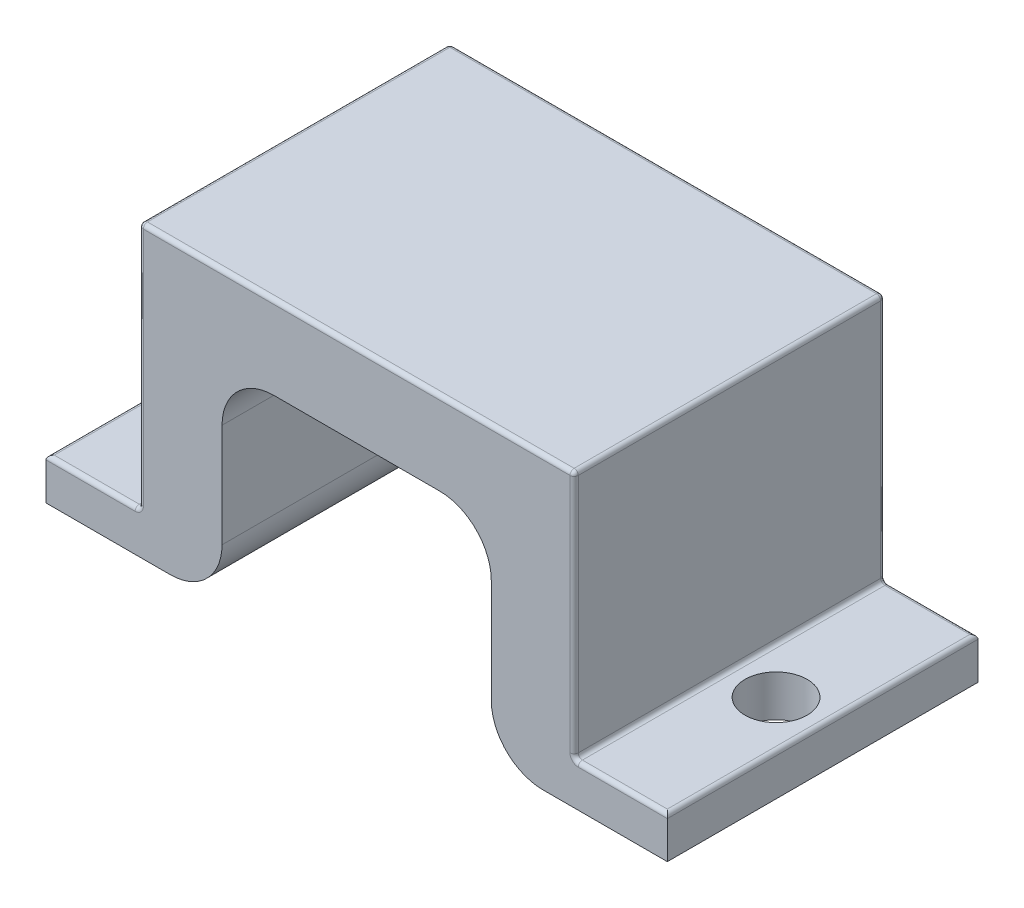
ISO-10303-21;
HEADER;
FILE_DESCRIPTION(('STEP AP214'),'2;1');
FILE_NAME('part.step','',(''),(''),'','','');
FILE_SCHEMA(('AUTOMOTIVE_DESIGN { 1 0 10303 214 1 1 1 1 }'));
ENDSEC;
DATA;
#1=APPLICATION_CONTEXT('core data for automotive mechanical design processes');
#2=APPLICATION_PROTOCOL_DEFINITION('international standard','automotive_design',2000,#1);
#3=PRODUCT_CONTEXT('',#1,'mechanical');
#4=PRODUCT('Part','Part','',(#3));
#5=PRODUCT_RELATED_PRODUCT_CATEGORY('part','',(#4));
#6=PRODUCT_DEFINITION_FORMATION('','',#4);
#7=PRODUCT_DEFINITION_CONTEXT('part definition',#1,'design');
#8=PRODUCT_DEFINITION('design','',#6,#7);
#9=PRODUCT_DEFINITION_SHAPE('','',#8);
#10=(LENGTH_UNIT() NAMED_UNIT(*) SI_UNIT(.MILLI.,.METRE.));
#11=(NAMED_UNIT(*) PLANE_ANGLE_UNIT() SI_UNIT($,.RADIAN.));
#12=(NAMED_UNIT(*) SI_UNIT($,.STERADIAN.) SOLID_ANGLE_UNIT());
#13=UNCERTAINTY_MEASURE_WITH_UNIT(LENGTH_MEASURE(1.E-05),#10,'distance_accuracy_value','');
#14=(GEOMETRIC_REPRESENTATION_CONTEXT(3) GLOBAL_UNCERTAINTY_ASSIGNED_CONTEXT((#13)) GLOBAL_UNIT_ASSIGNED_CONTEXT((#10,
#11,#12)) REPRESENTATION_CONTEXT('',''));
#15=CARTESIAN_POINT('',(0.,0.,0.));
#16=DIRECTION('',(0.,0.,1.));
#17=DIRECTION('',(1.,0.,0.));
#18=AXIS2_PLACEMENT_3D('',#15,#16,#17);
#19=CARTESIAN_POINT('',(-10.4973262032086,2.,15.));
#20=DIRECTION('',(1.,0.,0.));
#21=DIRECTION('',(0.,0.,-1.));
#22=AXIS2_PLACEMENT_3D('',#19,#20,#21);
#23=PLANE('',#22);
#24=DIRECTION('',(0.,-1.,0.));
#25=VECTOR('',#24,1.);
#26=CARTESIAN_POINT('',(-10.4973262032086,2.,15.));
#27=LINE('',#26,#25);
#28=CARTESIAN_POINT('',(-10.4973262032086,1.8,15.));
#29=VERTEX_POINT('',#28);
#30=CARTESIAN_POINT('',(-10.4973262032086,0.,15.));
#31=VERTEX_POINT('',#30);
#32=EDGE_CURVE('E229',#29,#31,#27,.T.);
#33=ORIENTED_EDGE('',*,*,#32,.F.);
#34=DIRECTION('',(0.,0.,-1.));
#35=VECTOR('',#34,1.);
#36=CARTESIAN_POINT('',(-10.4973262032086,1.8,15.));
#37=LINE('',#36,#35);
#38=CARTESIAN_POINT('',(-10.4973262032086,1.8,0.));
#39=VERTEX_POINT('',#38);
#40=EDGE_CURVE('E379',#29,#39,#37,.T.);
#41=ORIENTED_EDGE('',*,*,#40,.T.);
#42=DIRECTION('',(0.,-1.,0.));
#43=VECTOR('',#42,1.);
#44=CARTESIAN_POINT('',(-10.4973262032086,2.,0.));
#45=LINE('',#44,#43);
#46=CARTESIAN_POINT('',(-10.4973262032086,0.,0.));
#47=VERTEX_POINT('',#46);
#48=EDGE_CURVE('E254',#39,#47,#45,.T.);
#49=ORIENTED_EDGE('',*,*,#48,.T.);
#50=DIRECTION('',(0.,0.,-1.));
#51=VECTOR('',#50,1.);
#52=CARTESIAN_POINT('',(-10.4973262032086,0.,15.));
#53=LINE('',#52,#51);
#54=EDGE_CURVE('E249',#31,#47,#53,.T.);
#55=ORIENTED_EDGE('',*,*,#54,.F.);
#56=EDGE_LOOP('',(#33,#41,#49,#55));
#57=FACE_BOUND('',#56,.T.);
#58=ADVANCED_FACE('F44',(#57),#23,.F.);
#59=CARTESIAN_POINT('',(-10.4973262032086,0.,15.));
#60=DIRECTION('',(0.,1.,0.));
#61=DIRECTION('',(0.,0.,1.));
#62=AXIS2_PLACEMENT_3D('',#59,#60,#61);
#63=PLANE('',#62);
#64=CARTESIAN_POINT('',(-8.24732620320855,0.,7.5));
#65=DIRECTION('',(0.,1.,0.));
#66=DIRECTION('',(0.,0.,1.));
#67=AXIS2_PLACEMENT_3D('',#64,#65,#66);
#68=CIRCLE('',#67,1.5);
#69=CARTESIAN_POINT('',(-8.24732620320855,0.,9.));
#70=VERTEX_POINT('',#69);
#71=EDGE_CURVE('E1059',#70,#70,#68,.T.);
#72=ORIENTED_EDGE('',*,*,#71,.T.);
#73=EDGE_LOOP('',(#72));
#74=FACE_BOUND('',#73,.T.);
#75=DIRECTION('',(1.,0.,0.));
#76=VECTOR('',#75,1.);
#77=CARTESIAN_POINT('',(-10.4973262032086,0.,0.));
#78=LINE('',#77,#76);
#79=CARTESIAN_POINT('',(-4.49732620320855,0.,0.));
#80=VERTEX_POINT('',#79);
#81=EDGE_CURVE('E549',#47,#80,#78,.T.);
#82=ORIENTED_EDGE('',*,*,#81,.T.);
#83=DIRECTION('',(0.,0.,-1.));
#84=VECTOR('',#83,1.);
#85=CARTESIAN_POINT('',(-4.49732620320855,0.,15.));
#86=LINE('',#85,#84);
#87=CARTESIAN_POINT('',(-4.49732620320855,0.,15.));
#88=VERTEX_POINT('',#87);
#89=EDGE_CURVE('E250',#80,#88,#86,.F.);
#90=ORIENTED_EDGE('',*,*,#89,.T.);
#91=DIRECTION('',(1.,0.,0.));
#92=VECTOR('',#91,1.);
#93=CARTESIAN_POINT('',(-10.4973262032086,0.,15.));
#94=LINE('',#93,#92);
#95=EDGE_CURVE('E233',#31,#88,#94,.T.);
#96=ORIENTED_EDGE('',*,*,#95,.F.);
#97=ORIENTED_EDGE('',*,*,#54,.T.);
#98=EDGE_LOOP('',(#82,#90,#96,#97));
#99=FACE_BOUND('',#98,.T.);
#100=ADVANCED_FACE('F247',(#74,#99),#63,.F.);
#101=CARTESIAN_POINT('',(-1.99732620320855,0.,15.));
#102=DIRECTION('',(-1.,0.,0.));
#103=DIRECTION('',(0.,0.,1.));
#104=AXIS2_PLACEMENT_3D('',#101,#102,#103);
#105=PLANE('',#104);
#106=DIRECTION('',(0.,1.,0.));
#107=VECTOR('',#106,1.);
#108=CARTESIAN_POINT('',(-1.99732620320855,0.,15.));
#109=LINE('',#108,#107);
#110=CARTESIAN_POINT('',(-1.99732620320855,2.5,15.));
#111=VERTEX_POINT('',#110);
#112=CARTESIAN_POINT('',(-1.99732620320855,7.5,15.));
#113=VERTEX_POINT('',#112);
#114=EDGE_CURVE('E252',#111,#113,#109,.T.);
#115=ORIENTED_EDGE('',*,*,#114,.F.);
#116=DIRECTION('',(0.,0.,-1.));
#117=VECTOR('',#116,1.);
#118=CARTESIAN_POINT('',(-1.99732620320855,2.5,15.));
#119=LINE('',#118,#117);
#120=CARTESIAN_POINT('',(-1.99732620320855,2.5,0.));
#121=VERTEX_POINT('',#120);
#122=EDGE_CURVE('E522',#111,#121,#119,.T.);
#123=ORIENTED_EDGE('',*,*,#122,.T.);
#124=DIRECTION('',(0.,1.,0.));
#125=VECTOR('',#124,1.);
#126=CARTESIAN_POINT('',(-1.99732620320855,0.,0.));
#127=LINE('',#126,#125);
#128=CARTESIAN_POINT('',(-1.99732620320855,7.5,0.));
#129=VERTEX_POINT('',#128);
#130=EDGE_CURVE('E539',#121,#129,#127,.T.);
#131=ORIENTED_EDGE('',*,*,#130,.T.);
#132=DIRECTION('',(0.,0.,-1.));
#133=VECTOR('',#132,1.);
#134=CARTESIAN_POINT('',(-1.99732620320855,7.5,15.));
#135=LINE('',#134,#133);
#136=EDGE_CURVE('E518',#129,#113,#135,.F.);
#137=ORIENTED_EDGE('',*,*,#136,.T.);
#138=EDGE_LOOP('',(#115,#123,#131,#137));
#139=FACE_BOUND('',#138,.T.);
#140=ADVANCED_FACE('F550',(#139),#105,.F.);
#141=CARTESIAN_POINT('',(-1.99732620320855,10.,15.));
#142=DIRECTION('',(0.,1.,0.));
#143=DIRECTION('',(0.,0.,1.));
#144=AXIS2_PLACEMENT_3D('',#141,#142,#143);
#145=PLANE('',#144);
#146=DIRECTION('',(1.,0.,0.));
#147=VECTOR('',#146,1.);
#148=CARTESIAN_POINT('',(-1.99732620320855,10.,0.));
#149=LINE('',#148,#147);
#150=CARTESIAN_POINT('',(0.502673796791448,10.,0.));
#151=VERTEX_POINT('',#150);
#152=CARTESIAN_POINT('',(8.50267379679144,10.,0.));
#153=VERTEX_POINT('',#152);
#154=EDGE_CURVE('E541',#151,#153,#149,.T.);
#155=ORIENTED_EDGE('',*,*,#154,.T.);
#156=DIRECTION('',(0.,0.,-1.));
#157=VECTOR('',#156,1.);
#158=CARTESIAN_POINT('',(8.50267379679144,10.,15.));
#159=LINE('',#158,#157);
#160=CARTESIAN_POINT('',(8.50267379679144,10.,15.));
#161=VERTEX_POINT('',#160);
#162=EDGE_CURVE('E61',#153,#161,#159,.F.);
#163=ORIENTED_EDGE('',*,*,#162,.T.);
#164=DIRECTION('',(1.,0.,0.));
#165=VECTOR('',#164,1.);
#166=CARTESIAN_POINT('',(-1.99732620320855,10.,15.));
#167=LINE('',#166,#165);
#168=CARTESIAN_POINT('',(0.502673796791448,10.,15.));
#169=VERTEX_POINT('',#168);
#170=EDGE_CURVE('E554',#169,#161,#167,.T.);
#171=ORIENTED_EDGE('',*,*,#170,.F.);
#172=DIRECTION('',(0.,0.,-1.));
#173=VECTOR('',#172,1.);
#174=CARTESIAN_POINT('',(0.502673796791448,10.,0.));
#175=LINE('',#174,#173);
#176=EDGE_CURVE('E511',#169,#151,#175,.T.);
#177=ORIENTED_EDGE('',*,*,#176,.T.);
#178=EDGE_LOOP('',(#155,#163,#171,#177));
#179=FACE_BOUND('',#178,.T.);
#180=ADVANCED_FACE('F555',(#179),#145,.F.);
#181=CARTESIAN_POINT('',(11.0026737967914,10.,15.));
#182=DIRECTION('',(1.,0.,0.));
#183=DIRECTION('',(0.,1.,0.));
#184=AXIS2_PLACEMENT_3D('',#181,#182,#183);
#185=PLANE('',#184);
#186=DIRECTION('',(0.,-1.,0.));
#187=VECTOR('',#186,1.);
#188=CARTESIAN_POINT('',(11.0026737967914,10.,0.));
#189=LINE('',#188,#187);
#190=CARTESIAN_POINT('',(11.0026737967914,7.5,0.));
#191=VERTEX_POINT('',#190);
#192=CARTESIAN_POINT('',(11.0026737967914,2.5,0.));
#193=VERTEX_POINT('',#192);
#194=EDGE_CURVE('E574',#191,#193,#189,.T.);
#195=ORIENTED_EDGE('',*,*,#194,.T.);
#196=DIRECTION('',(0.,0.,-1.));
#197=VECTOR('',#196,1.);
#198=CARTESIAN_POINT('',(11.0026737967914,2.5,15.));
#199=LINE('',#198,#197);
#200=CARTESIAN_POINT('',(11.0026737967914,2.5,15.));
#201=VERTEX_POINT('',#200);
#202=EDGE_CURVE('E503',#193,#201,#199,.F.);
#203=ORIENTED_EDGE('',*,*,#202,.T.);
#204=DIRECTION('',(0.,-1.,0.));
#205=VECTOR('',#204,1.);
#206=CARTESIAN_POINT('',(11.0026737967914,10.,15.));
#207=LINE('',#206,#205);
#208=CARTESIAN_POINT('',(11.0026737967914,7.5,15.));
#209=VERTEX_POINT('',#208);
#210=EDGE_CURVE('E556',#209,#201,#207,.T.);
#211=ORIENTED_EDGE('',*,*,#210,.F.);
#212=DIRECTION('',(0.,0.,-1.));
#213=VECTOR('',#212,1.);
#214=CARTESIAN_POINT('',(11.0026737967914,7.5,0.));
#215=LINE('',#214,#213);
#216=EDGE_CURVE('E498',#209,#191,#215,.T.);
#217=ORIENTED_EDGE('',*,*,#216,.T.);
#218=EDGE_LOOP('',(#195,#203,#211,#217));
#219=FACE_BOUND('',#218,.T.);
#220=ADVANCED_FACE('F768',(#219),#185,.F.);
#221=CARTESIAN_POINT('',(11.0026737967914,0.,15.));
#222=DIRECTION('',(0.,1.,0.));
#223=DIRECTION('',(0.,0.,1.));
#224=AXIS2_PLACEMENT_3D('',#221,#222,#223);
#225=PLANE('',#224);
#226=CARTESIAN_POINT('',(17.2526737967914,0.,7.5));
#227=DIRECTION('',(0.,1.,0.));
#228=DIRECTION('',(0.,0.,1.));
#229=AXIS2_PLACEMENT_3D('',#226,#227,#228);
#230=CIRCLE('',#229,1.5);
#231=CARTESIAN_POINT('',(17.2526737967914,0.,9.));
#232=VERTEX_POINT('',#231);
#233=EDGE_CURVE('E389',#232,#232,#230,.T.);
#234=ORIENTED_EDGE('',*,*,#233,.T.);
#235=EDGE_LOOP('',(#234));
#236=FACE_BOUND('',#235,.T.);
#237=DIRECTION('',(1.,0.,0.));
#238=VECTOR('',#237,1.);
#239=CARTESIAN_POINT('',(11.0026737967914,0.,15.));
#240=LINE('',#239,#238);
#241=CARTESIAN_POINT('',(13.5026737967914,0.,15.));
#242=VERTEX_POINT('',#241);
#243=CARTESIAN_POINT('',(19.5026737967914,0.,15.));
#244=VERTEX_POINT('',#243);
#245=EDGE_CURVE('E559',#242,#244,#240,.T.);
#246=ORIENTED_EDGE('',*,*,#245,.F.);
#247=DIRECTION('',(0.,0.,-1.));
#248=VECTOR('',#247,1.);
#249=CARTESIAN_POINT('',(13.5026737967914,0.,15.));
#250=LINE('',#249,#248);
#251=CARTESIAN_POINT('',(13.5026737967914,0.,0.));
#252=VERTEX_POINT('',#251);
#253=EDGE_CURVE('E382',#242,#252,#250,.T.);
#254=ORIENTED_EDGE('',*,*,#253,.T.);
#255=DIRECTION('',(1.,0.,0.));
#256=VECTOR('',#255,1.);
#257=CARTESIAN_POINT('',(11.0026737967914,0.,0.));
#258=LINE('',#257,#256);
#259=CARTESIAN_POINT('',(19.5026737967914,0.,0.));
#260=VERTEX_POINT('',#259);
#261=EDGE_CURVE('E578',#252,#260,#258,.T.);
#262=ORIENTED_EDGE('',*,*,#261,.T.);
#263=DIRECTION('',(0.,0.,-1.));
#264=VECTOR('',#263,1.);
#265=CARTESIAN_POINT('',(19.5026737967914,0.,15.));
#266=LINE('',#265,#264);
#267=EDGE_CURVE('E259',#244,#260,#266,.T.);
#268=ORIENTED_EDGE('',*,*,#267,.F.);
#269=EDGE_LOOP('',(#246,#254,#262,#268));
#270=FACE_BOUND('',#269,.T.);
#271=ADVANCED_FACE('F766',(#236,#270),#225,.F.);
#272=CARTESIAN_POINT('',(19.5026737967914,0.,15.));
#273=DIRECTION('',(-1.,0.,0.));
#274=DIRECTION('',(0.,0.,1.));
#275=AXIS2_PLACEMENT_3D('',#272,#273,#274);
#276=PLANE('',#275);
#277=DIRECTION('',(0.,1.,0.));
#278=VECTOR('',#277,1.);
#279=CARTESIAN_POINT('',(19.5026737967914,0.,0.));
#280=LINE('',#279,#278);
#281=CARTESIAN_POINT('',(19.5026737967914,1.8,0.));
#282=VERTEX_POINT('',#281);
#283=EDGE_CURVE('E245',#260,#282,#280,.T.);
#284=ORIENTED_EDGE('',*,*,#283,.T.);
#285=DIRECTION('',(0.,0.,-1.));
#286=VECTOR('',#285,1.);
#287=CARTESIAN_POINT('',(19.5026737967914,1.8,15.));
#288=LINE('',#287,#286);
#289=CARTESIAN_POINT('',(19.5026737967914,1.8,15.));
#290=VERTEX_POINT('',#289);
#291=EDGE_CURVE('E276',#282,#290,#288,.F.);
#292=ORIENTED_EDGE('',*,*,#291,.T.);
#293=DIRECTION('',(0.,1.,0.));
#294=VECTOR('',#293,1.);
#295=CARTESIAN_POINT('',(19.5026737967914,0.,15.));
#296=LINE('',#295,#294);
#297=EDGE_CURVE('E266',#244,#290,#296,.T.);
#298=ORIENTED_EDGE('',*,*,#297,.F.);
#299=ORIENTED_EDGE('',*,*,#267,.T.);
#300=EDGE_LOOP('',(#284,#292,#298,#299));
#301=FACE_BOUND('',#300,.T.);
#302=ADVANCED_FACE('F588',(#301),#276,.F.);
#303=CARTESIAN_POINT('',(19.5026737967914,2.,15.));
#304=DIRECTION('',(0.,-1.,0.));
#305=DIRECTION('',(1.,0.,0.));
#306=AXIS2_PLACEMENT_3D('',#303,#304,#305);
#307=PLANE('',#306);
#308=CARTESIAN_POINT('',(17.2526737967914,2.,7.5));
#309=DIRECTION('',(0.,1.,0.));
#310=DIRECTION('',(-1.,0.,0.));
#311=AXIS2_PLACEMENT_3D('',#308,#309,#310);
#312=CIRCLE('',#311,1.5);
#313=CARTESIAN_POINT('',(15.7526737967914,2.,7.5));
#314=VERTEX_POINT('',#313);
#315=EDGE_CURVE('E1060',#314,#314,#312,.T.);
#316=ORIENTED_EDGE('',*,*,#315,.F.);
#317=EDGE_LOOP('',(#316));
#318=FACE_BOUND('',#317,.T.);
#319=DIRECTION('',(-1.,0.,0.));
#320=VECTOR('',#319,1.);
#321=CARTESIAN_POINT('',(19.5026737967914,2.,14.8));
#322=LINE('',#321,#320);
#323=CARTESIAN_POINT('',(15.2026737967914,2.,14.8));
#324=VERTEX_POINT('',#323);
#325=CARTESIAN_POINT('',(19.3026737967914,2.,14.8));
#326=VERTEX_POINT('',#325);
#327=EDGE_CURVE('E275',#324,#326,#322,.F.);
#328=ORIENTED_EDGE('',*,*,#327,.T.);
#329=DIRECTION('',(0.,0.,-1.));
#330=VECTOR('',#329,1.);
#331=CARTESIAN_POINT('',(19.3026737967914,2.,15.));
#332=LINE('',#331,#330);
#333=CARTESIAN_POINT('',(19.3026737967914,2.,0.200000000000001));
#334=VERTEX_POINT('',#333);
#335=EDGE_CURVE('E274',#326,#334,#332,.T.);
#336=ORIENTED_EDGE('',*,*,#335,.T.);
#337=DIRECTION('',(-1.,0.,0.));
#338=VECTOR('',#337,1.);
#339=CARTESIAN_POINT('',(19.5026737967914,2.,0.200000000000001));
#340=LINE('',#339,#338);
#341=CARTESIAN_POINT('',(15.2026737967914,2.,0.200000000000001));
#342=VERTEX_POINT('',#341);
#343=EDGE_CURVE('E263',#334,#342,#340,.T.);
#344=ORIENTED_EDGE('',*,*,#343,.T.);
#345=DIRECTION('',(0.,0.,-1.));
#346=VECTOR('',#345,1.);
#347=CARTESIAN_POINT('',(15.2026737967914,2.,15.));
#348=LINE('',#347,#346);
#349=EDGE_CURVE('E256',#342,#324,#348,.F.);
#350=ORIENTED_EDGE('',*,*,#349,.T.);
#351=EDGE_LOOP('',(#328,#336,#344,#350));
#352=FACE_BOUND('',#351,.T.);
#353=ADVANCED_FACE('F605',(#318,#352),#307,.F.);
#354=CARTESIAN_POINT('',(15.0026737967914,2.,15.));
#355=DIRECTION('',(-1.,0.,0.));
#356=DIRECTION('',(0.,0.,1.));
#357=AXIS2_PLACEMENT_3D('',#354,#355,#356);
#358=PLANE('',#357);
#359=DIRECTION('',(0.,1.,0.));
#360=VECTOR('',#359,1.);
#361=CARTESIAN_POINT('',(15.0026737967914,2.,14.8));
#362=LINE('',#361,#360);
#363=CARTESIAN_POINT('',(15.0026737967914,13.8,14.8));
#364=VERTEX_POINT('',#363);
#365=CARTESIAN_POINT('',(15.0026737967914,2.2,14.8));
#366=VERTEX_POINT('',#365);
#367=EDGE_CURVE('E331',#364,#366,#362,.F.);
#368=ORIENTED_EDGE('',*,*,#367,.T.);
#369=DIRECTION('',(0.,0.,-1.));
#370=VECTOR('',#369,1.);
#371=CARTESIAN_POINT('',(15.0026737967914,2.2,0.));
#372=LINE('',#371,#370);
#373=CARTESIAN_POINT('',(15.0026737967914,2.2,0.200000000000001));
#374=VERTEX_POINT('',#373);
#375=EDGE_CURVE('E340',#366,#374,#372,.T.);
#376=ORIENTED_EDGE('',*,*,#375,.T.);
#377=DIRECTION('',(0.,1.,0.));
#378=VECTOR('',#377,1.);
#379=CARTESIAN_POINT('',(15.0026737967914,2.,0.200000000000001));
#380=LINE('',#379,#378);
#381=CARTESIAN_POINT('',(15.0026737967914,13.8,0.200000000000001));
#382=VERTEX_POINT('',#381);
#383=EDGE_CURVE('E332',#374,#382,#380,.T.);
#384=ORIENTED_EDGE('',*,*,#383,.T.);
#385=DIRECTION('',(0.,0.,-1.));
#386=VECTOR('',#385,1.);
#387=CARTESIAN_POINT('',(15.0026737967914,13.8,15.));
#388=LINE('',#387,#386);
#389=EDGE_CURVE('E327',#382,#364,#388,.F.);
#390=ORIENTED_EDGE('',*,*,#389,.T.);
#391=EDGE_LOOP('',(#368,#376,#384,#390));
#392=FACE_BOUND('',#391,.T.);
#393=ADVANCED_FACE('F817',(#392),#358,.F.);
#394=CARTESIAN_POINT('',(15.0026737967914,14.,15.));
#395=DIRECTION('',(0.,-1.,0.));
#396=DIRECTION('',(1.,0.,0.));
#397=AXIS2_PLACEMENT_3D('',#394,#395,#396);
#398=PLANE('',#397);
#399=DIRECTION('',(-1.,0.,0.));
#400=VECTOR('',#399,1.);
#401=CARTESIAN_POINT('',(15.0026737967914,14.,14.8));
#402=LINE('',#401,#400);
#403=CARTESIAN_POINT('',(-5.79732620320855,14.,14.8));
#404=VERTEX_POINT('',#403);
#405=CARTESIAN_POINT('',(14.8026737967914,14.,14.8));
#406=VERTEX_POINT('',#405);
#407=EDGE_CURVE('E350',#404,#406,#402,.F.);
#408=ORIENTED_EDGE('',*,*,#407,.T.);
#409=DIRECTION('',(0.,0.,-1.));
#410=VECTOR('',#409,1.);
#411=CARTESIAN_POINT('',(14.8026737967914,14.,15.));
#412=LINE('',#411,#410);
#413=CARTESIAN_POINT('',(14.8026737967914,14.,0.200000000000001));
#414=VERTEX_POINT('',#413);
#415=EDGE_CURVE('E348',#406,#414,#412,.T.);
#416=ORIENTED_EDGE('',*,*,#415,.T.);
#417=DIRECTION('',(-1.,0.,0.));
#418=VECTOR('',#417,1.);
#419=CARTESIAN_POINT('',(15.0026737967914,14.,0.200000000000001));
#420=LINE('',#419,#418);
#421=CARTESIAN_POINT('',(-5.79732620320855,14.,0.200000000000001));
#422=VERTEX_POINT('',#421);
#423=EDGE_CURVE('E343',#414,#422,#420,.T.);
#424=ORIENTED_EDGE('',*,*,#423,.T.);
#425=DIRECTION('',(0.,0.,-1.));
#426=VECTOR('',#425,1.);
#427=CARTESIAN_POINT('',(-5.79732620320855,14.,15.));
#428=LINE('',#427,#426);
#429=EDGE_CURVE('E341',#422,#404,#428,.F.);
#430=ORIENTED_EDGE('',*,*,#429,.T.);
#431=EDGE_LOOP('',(#408,#416,#424,#430));
#432=FACE_BOUND('',#431,.T.);
#433=ADVANCED_FACE('F634',(#432),#398,.F.);
#434=CARTESIAN_POINT('',(-5.99732620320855,14.,15.));
#435=DIRECTION('',(1.,0.,0.));
#436=DIRECTION('',(0.,1.,0.));
#437=AXIS2_PLACEMENT_3D('',#434,#435,#436);
#438=PLANE('',#437);
#439=DIRECTION('',(0.,-1.,0.));
#440=VECTOR('',#439,1.);
#441=CARTESIAN_POINT('',(-5.99732620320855,14.,14.8));
#442=LINE('',#441,#440);
#443=CARTESIAN_POINT('',(-5.99732620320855,2.2,14.8));
#444=VERTEX_POINT('',#443);
#445=CARTESIAN_POINT('',(-5.99732620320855,13.8,14.8));
#446=VERTEX_POINT('',#445);
#447=EDGE_CURVE('E360',#444,#446,#442,.F.);
#448=ORIENTED_EDGE('',*,*,#447,.T.);
#449=DIRECTION('',(0.,0.,-1.));
#450=VECTOR('',#449,1.);
#451=CARTESIAN_POINT('',(-5.99732620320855,13.8,15.));
#452=LINE('',#451,#450);
#453=CARTESIAN_POINT('',(-5.99732620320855,13.8,0.200000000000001));
#454=VERTEX_POINT('',#453);
#455=EDGE_CURVE('E361',#446,#454,#452,.T.);
#456=ORIENTED_EDGE('',*,*,#455,.T.);
#457=DIRECTION('',(0.,-1.,0.));
#458=VECTOR('',#457,1.);
#459=CARTESIAN_POINT('',(-5.99732620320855,14.,0.200000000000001));
#460=LINE('',#459,#458);
#461=CARTESIAN_POINT('',(-5.99732620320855,2.2,0.200000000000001));
#462=VERTEX_POINT('',#461);
#463=EDGE_CURVE('E357',#454,#462,#460,.T.);
#464=ORIENTED_EDGE('',*,*,#463,.T.);
#465=DIRECTION('',(0.,0.,-1.));
#466=VECTOR('',#465,1.);
#467=CARTESIAN_POINT('',(-5.99732620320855,2.2,15.));
#468=LINE('',#467,#466);
#469=EDGE_CURVE('E353',#462,#444,#468,.F.);
#470=ORIENTED_EDGE('',*,*,#469,.T.);
#471=EDGE_LOOP('',(#448,#456,#464,#470));
#472=FACE_BOUND('',#471,.T.);
#473=ADVANCED_FACE('F839',(#472),#438,.F.);
#474=CARTESIAN_POINT('',(-5.99732620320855,2.,15.));
#475=DIRECTION('',(0.,-1.,0.));
#476=DIRECTION('',(1.,0.,0.));
#477=AXIS2_PLACEMENT_3D('',#474,#475,#476);
#478=PLANE('',#477);
#479=CARTESIAN_POINT('',(-8.24732620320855,2.,7.5));
#480=DIRECTION('',(0.,1.,0.));
#481=DIRECTION('',(-1.,0.,0.));
#482=AXIS2_PLACEMENT_3D('',#479,#480,#481);
#483=CIRCLE('',#482,1.5);
#484=CARTESIAN_POINT('',(-9.74732620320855,2.,7.5));
#485=VERTEX_POINT('',#484);
#486=EDGE_CURVE('E1054',#485,#485,#483,.T.);
#487=ORIENTED_EDGE('',*,*,#486,.F.);
#488=EDGE_LOOP('',(#487));
#489=FACE_BOUND('',#488,.T.);
#490=DIRECTION('',(-1.,0.,0.));
#491=VECTOR('',#490,1.);
#492=CARTESIAN_POINT('',(-5.99732620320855,2.,14.8));
#493=LINE('',#492,#491);
#494=CARTESIAN_POINT('',(-10.2973262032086,2.,14.8));
#495=VERTEX_POINT('',#494);
#496=CARTESIAN_POINT('',(-6.19732620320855,2.,14.8));
#497=VERTEX_POINT('',#496);
#498=EDGE_CURVE('E373',#495,#497,#493,.F.);
#499=ORIENTED_EDGE('',*,*,#498,.T.);
#500=DIRECTION('',(0.,0.,-1.));
#501=VECTOR('',#500,1.);
#502=CARTESIAN_POINT('',(-6.19732620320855,2.,0.));
#503=LINE('',#502,#501);
#504=CARTESIAN_POINT('',(-6.19732620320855,2.,0.200000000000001));
#505=VERTEX_POINT('',#504);
#506=EDGE_CURVE('E376',#497,#505,#503,.T.);
#507=ORIENTED_EDGE('',*,*,#506,.T.);
#508=DIRECTION('',(-1.,0.,0.));
#509=VECTOR('',#508,1.);
#510=CARTESIAN_POINT('',(-5.99732620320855,2.,0.200000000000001));
#511=LINE('',#510,#509);
#512=CARTESIAN_POINT('',(-10.2973262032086,2.,0.200000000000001));
#513=VERTEX_POINT('',#512);
#514=EDGE_CURVE('E370',#505,#513,#511,.T.);
#515=ORIENTED_EDGE('',*,*,#514,.T.);
#516=DIRECTION('',(0.,0.,-1.));
#517=VECTOR('',#516,1.);
#518=CARTESIAN_POINT('',(-10.2973262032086,2.,15.));
#519=LINE('',#518,#517);
#520=EDGE_CURVE('E367',#513,#495,#519,.F.);
#521=ORIENTED_EDGE('',*,*,#520,.T.);
#522=EDGE_LOOP('',(#499,#507,#515,#521));
#523=FACE_BOUND('',#522,.T.);
#524=ADVANCED_FACE('F850',(#489,#523),#478,.F.);
#525=CARTESIAN_POINT('',(0.,0.,15.));
#526=DIRECTION('',(0.,0.,1.));
#527=DIRECTION('',(1.,0.,0.));
#528=AXIS2_PLACEMENT_3D('',#525,#526,#527);
#529=PLANE('',#528);
#530=ORIENTED_EDGE('',*,*,#210,.T.);
#531=CARTESIAN_POINT('',(13.5026737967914,2.5,15.));
#532=DIRECTION('',(0.,0.,1.));
#533=DIRECTION('',(1.,0.,0.));
#534=AXIS2_PLACEMENT_3D('',#531,#532,#533);
#535=CIRCLE('',#534,2.5);
#536=EDGE_CURVE('E510',#201,#242,#535,.T.);
#537=ORIENTED_EDGE('',*,*,#536,.T.);
#538=ORIENTED_EDGE('',*,*,#245,.T.);
#539=ORIENTED_EDGE('',*,*,#297,.T.);
#540=DIRECTION('',(-1.,0.,0.));
#541=VECTOR('',#540,1.);
#542=CARTESIAN_POINT('',(15.0026737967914,1.8,15.));
#543=LINE('',#542,#541);
#544=CARTESIAN_POINT('',(15.2026737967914,1.8,15.));
#545=VERTEX_POINT('',#544);
#546=EDGE_CURVE('E302',#290,#545,#543,.T.);
#547=ORIENTED_EDGE('',*,*,#546,.T.);
#548=CARTESIAN_POINT('',(15.2026737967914,2.2,15.));
#549=DIRECTION('',(0.,0.,1.));
#550=DIRECTION('',(1.,0.,0.));
#551=AXIS2_PLACEMENT_3D('',#548,#549,#550);
#552=CIRCLE('',#551,0.4);
#553=CARTESIAN_POINT('',(14.8026737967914,2.2,15.));
#554=VERTEX_POINT('',#553);
#555=EDGE_CURVE('E297',#554,#545,#552,.T.);
#556=ORIENTED_EDGE('',*,*,#555,.F.);
#557=DIRECTION('',(0.,1.,0.));
#558=VECTOR('',#557,1.);
#559=CARTESIAN_POINT('',(14.8026737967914,14.,15.));
#560=LINE('',#559,#558);
#561=CARTESIAN_POINT('',(14.8026737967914,13.8,15.));
#562=VERTEX_POINT('',#561);
#563=EDGE_CURVE('E293',#554,#562,#560,.T.);
#564=ORIENTED_EDGE('',*,*,#563,.T.);
#565=DIRECTION('',(-1.,0.,0.));
#566=VECTOR('',#565,1.);
#567=CARTESIAN_POINT('',(-5.99732620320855,13.8,15.));
#568=LINE('',#567,#566);
#569=CARTESIAN_POINT('',(-5.79732620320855,13.8,15.));
#570=VERTEX_POINT('',#569);
#571=EDGE_CURVE('E295',#562,#570,#568,.T.);
#572=ORIENTED_EDGE('',*,*,#571,.T.);
#573=DIRECTION('',(0.,-1.,0.));
#574=VECTOR('',#573,1.);
#575=CARTESIAN_POINT('',(-5.79732620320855,2.,15.));
#576=LINE('',#575,#574);
#577=CARTESIAN_POINT('',(-5.79732620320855,2.2,15.));
#578=VERTEX_POINT('',#577);
#579=EDGE_CURVE('E288',#570,#578,#576,.T.);
#580=ORIENTED_EDGE('',*,*,#579,.T.);
#581=CARTESIAN_POINT('',(-6.19732620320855,2.2,15.));
#582=DIRECTION('',(0.,0.,1.));
#583=DIRECTION('',(1.,0.,0.));
#584=AXIS2_PLACEMENT_3D('',#581,#582,#583);
#585=CIRCLE('',#584,0.4);
#586=CARTESIAN_POINT('',(-6.19732620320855,1.8,15.));
#587=VERTEX_POINT('',#586);
#588=EDGE_CURVE('E284',#587,#578,#585,.T.);
#589=ORIENTED_EDGE('',*,*,#588,.F.);
#590=DIRECTION('',(-1.,0.,0.));
#591=VECTOR('',#590,1.);
#592=CARTESIAN_POINT('',(-10.4973262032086,1.8,15.));
#593=LINE('',#592,#591);
#594=EDGE_CURVE('E240',#587,#29,#593,.T.);
#595=ORIENTED_EDGE('',*,*,#594,.T.);
#596=ORIENTED_EDGE('',*,*,#32,.T.);
#597=ORIENTED_EDGE('',*,*,#95,.T.);
#598=CARTESIAN_POINT('',(-4.49732620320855,2.5,15.));
#599=DIRECTION('',(0.,0.,1.));
#600=DIRECTION('',(1.,0.,0.));
#601=AXIS2_PLACEMENT_3D('',#598,#599,#600);
#602=CIRCLE('',#601,2.5);
#603=EDGE_CURVE('E507',#88,#111,#602,.T.);
#604=ORIENTED_EDGE('',*,*,#603,.T.);
#605=ORIENTED_EDGE('',*,*,#114,.T.);
#606=CARTESIAN_POINT('',(0.502673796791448,7.5,15.));
#607=DIRECTION('',(0.,0.,1.));
#608=DIRECTION('',(1.,0.,0.));
#609=AXIS2_PLACEMENT_3D('',#606,#607,#608);
#610=CIRCLE('',#609,2.5);
#611=EDGE_CURVE('E11',#113,#169,#610,.F.);
#612=ORIENTED_EDGE('',*,*,#611,.T.);
#613=ORIENTED_EDGE('',*,*,#170,.T.);
#614=CARTESIAN_POINT('',(8.50267379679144,7.5,15.));
#615=DIRECTION('',(0.,0.,1.));
#616=DIRECTION('',(1.,0.,0.));
#617=AXIS2_PLACEMENT_3D('',#614,#615,#616);
#618=CIRCLE('',#617,2.5);
#619=EDGE_CURVE('E533',#161,#209,#618,.F.);
#620=ORIENTED_EDGE('',*,*,#619,.T.);
#621=EDGE_LOOP('',(#530,#537,#538,#539,#547,#556,#564,#572,#580,#589,#595,#596,#597,#604,#605,
#612,#613,#620));
#622=FACE_BOUND('',#621,.T.);
#623=ADVANCED_FACE('F234',(#622),#529,.T.);
#624=CARTESIAN_POINT('',(0.,0.,0.));
#625=DIRECTION('',(0.,0.,1.));
#626=DIRECTION('',(1.,0.,0.));
#627=AXIS2_PLACEMENT_3D('',#624,#625,#626);
#628=PLANE('',#627);
#629=ORIENTED_EDGE('',*,*,#261,.F.);
#630=CARTESIAN_POINT('',(13.5026737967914,2.5,0.));
#631=DIRECTION('',(0.,0.,1.));
#632=DIRECTION('',(1.,0.,0.));
#633=AXIS2_PLACEMENT_3D('',#630,#631,#632);
#634=CIRCLE('',#633,2.5);
#635=EDGE_CURVE('E500',#252,#193,#634,.F.);
#636=ORIENTED_EDGE('',*,*,#635,.T.);
#637=ORIENTED_EDGE('',*,*,#194,.F.);
#638=CARTESIAN_POINT('',(8.50267379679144,7.5,0.));
#639=DIRECTION('',(0.,0.,1.));
#640=DIRECTION('',(1.,0.,0.));
#641=AXIS2_PLACEMENT_3D('',#638,#639,#640);
#642=CIRCLE('',#641,2.5);
#643=EDGE_CURVE('E526',#191,#153,#642,.T.);
#644=ORIENTED_EDGE('',*,*,#643,.T.);
#645=ORIENTED_EDGE('',*,*,#154,.F.);
#646=CARTESIAN_POINT('',(0.502673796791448,7.5,0.));
#647=DIRECTION('',(0.,0.,1.));
#648=DIRECTION('',(1.,0.,0.));
#649=AXIS2_PLACEMENT_3D('',#646,#647,#648);
#650=CIRCLE('',#649,2.5);
#651=EDGE_CURVE('E53',#151,#129,#650,.T.);
#652=ORIENTED_EDGE('',*,*,#651,.T.);
#653=ORIENTED_EDGE('',*,*,#130,.F.);
#654=CARTESIAN_POINT('',(-4.49732620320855,2.5,0.));
#655=DIRECTION('',(0.,0.,1.));
#656=DIRECTION('',(1.,0.,0.));
#657=AXIS2_PLACEMENT_3D('',#654,#655,#656);
#658=CIRCLE('',#657,2.5);
#659=EDGE_CURVE('E493',#121,#80,#658,.F.);
#660=ORIENTED_EDGE('',*,*,#659,.T.);
#661=ORIENTED_EDGE('',*,*,#81,.F.);
#662=ORIENTED_EDGE('',*,*,#48,.F.);
#663=DIRECTION('',(-1.,0.,0.));
#664=VECTOR('',#663,1.);
#665=CARTESIAN_POINT('',(0.,1.8,0.));
#666=LINE('',#665,#664);
#667=CARTESIAN_POINT('',(-6.19732620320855,1.8,0.));
#668=VERTEX_POINT('',#667);
#669=EDGE_CURVE('E310',#39,#668,#666,.F.);
#670=ORIENTED_EDGE('',*,*,#669,.T.);
#671=CARTESIAN_POINT('',(-6.19732620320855,2.2,0.));
#672=DIRECTION('',(0.,0.,1.));
#673=DIRECTION('',(1.,0.,0.));
#674=AXIS2_PLACEMENT_3D('',#671,#672,#673);
#675=CIRCLE('',#674,0.4);
#676=CARTESIAN_POINT('',(-5.79732620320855,2.2,0.));
#677=VERTEX_POINT('',#676);
#678=EDGE_CURVE('E305',#677,#668,#675,.F.);
#679=ORIENTED_EDGE('',*,*,#678,.F.);
#680=DIRECTION('',(0.,-1.,0.));
#681=VECTOR('',#680,1.);
#682=CARTESIAN_POINT('',(-5.79732620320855,0.,0.));
#683=LINE('',#682,#681);
#684=CARTESIAN_POINT('',(-5.79732620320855,13.8,0.));
#685=VERTEX_POINT('',#684);
#686=EDGE_CURVE('E315',#677,#685,#683,.F.);
#687=ORIENTED_EDGE('',*,*,#686,.T.);
#688=DIRECTION('',(-1.,0.,0.));
#689=VECTOR('',#688,1.);
#690=CARTESIAN_POINT('',(0.,13.8,0.));
#691=LINE('',#690,#689);
#692=CARTESIAN_POINT('',(14.8026737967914,13.8,0.));
#693=VERTEX_POINT('',#692);
#694=EDGE_CURVE('E312',#685,#693,#691,.F.);
#695=ORIENTED_EDGE('',*,*,#694,.T.);
#696=DIRECTION('',(0.,1.,0.));
#697=VECTOR('',#696,1.);
#698=CARTESIAN_POINT('',(14.8026737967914,0.,0.));
#699=LINE('',#698,#697);
#700=CARTESIAN_POINT('',(14.8026737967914,2.2,0.));
#701=VERTEX_POINT('',#700);
#702=EDGE_CURVE('E318',#693,#701,#699,.F.);
#703=ORIENTED_EDGE('',*,*,#702,.T.);
#704=CARTESIAN_POINT('',(15.2026737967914,2.2,0.));
#705=DIRECTION('',(0.,0.,1.));
#706=DIRECTION('',(1.,0.,0.));
#707=AXIS2_PLACEMENT_3D('',#704,#705,#706);
#708=CIRCLE('',#707,0.4);
#709=CARTESIAN_POINT('',(15.2026737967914,1.8,0.));
#710=VERTEX_POINT('',#709);
#711=EDGE_CURVE('E321',#710,#701,#708,.F.);
#712=ORIENTED_EDGE('',*,*,#711,.F.);
#713=DIRECTION('',(-1.,0.,0.));
#714=VECTOR('',#713,1.);
#715=CARTESIAN_POINT('',(0.,1.8,0.));
#716=LINE('',#715,#714);
#717=EDGE_CURVE('E324',#710,#282,#716,.F.);
#718=ORIENTED_EDGE('',*,*,#717,.T.);
#719=ORIENTED_EDGE('',*,*,#283,.F.);
#720=EDGE_LOOP('',(#629,#636,#637,#644,#645,#652,#653,#660,#661,#662,#670,#679,#687,#695,#703,
#712,#718,#719));
#721=FACE_BOUND('',#720,.T.);
#722=ADVANCED_FACE('F537',(#721),#628,.F.);
#723=CARTESIAN_POINT('',(-10.2973262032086,1.8,15.));
#724=DIRECTION('',(0.,0.,-1.));
#725=DIRECTION('',(-1.,0.,0.));
#726=AXIS2_PLACEMENT_3D('',#723,#724,#725);
#727=CYLINDRICAL_SURFACE('',#726,0.2);
#728=CARTESIAN_POINT('',(-10.2973262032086,1.8,0.200000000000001));
#729=DIRECTION('',(-0.707106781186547,0.,0.707106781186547));
#730=DIRECTION('',(-0.707106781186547,0.,-0.707106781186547));
#731=AXIS2_PLACEMENT_3D('',#728,#729,#730);
#732=ELLIPSE('',#731,0.282842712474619,0.2);
#733=EDGE_CURVE('E483',#39,#513,#732,.F.);
#734=ORIENTED_EDGE('',*,*,#733,.F.);
#735=ORIENTED_EDGE('',*,*,#40,.F.);
#736=CARTESIAN_POINT('',(-10.2973262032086,1.8,14.8));
#737=DIRECTION('',(-0.707106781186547,0.,-0.707106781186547));
#738=DIRECTION('',(0.707106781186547,0.,-0.707106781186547));
#739=AXIS2_PLACEMENT_3D('',#736,#737,#738);
#740=ELLIPSE('',#739,0.282842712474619,0.2);
#741=EDGE_CURVE('E490',#495,#29,#740,.F.);
#742=ORIENTED_EDGE('',*,*,#741,.F.);
#743=ORIENTED_EDGE('',*,*,#520,.F.);
#744=EDGE_LOOP('',(#734,#735,#742,#743));
#745=FACE_BOUND('',#744,.T.);
#746=ADVANCED_FACE('F657',(#745),#727,.T.);
#747=CARTESIAN_POINT('',(0.,1.8,14.8));
#748=DIRECTION('',(1.,0.,0.));
#749=DIRECTION('',(0.,1.,0.));
#750=AXIS2_PLACEMENT_3D('',#747,#748,#749);
#751=CYLINDRICAL_SURFACE('',#750,0.2);
#752=ORIENTED_EDGE('',*,*,#741,.T.);
#753=ORIENTED_EDGE('',*,*,#594,.F.);
#754=CARTESIAN_POINT('',(-6.19732620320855,1.8,14.8));
#755=DIRECTION('',(1.,0.,0.));
#756=DIRECTION('',(0.,0.,-1.));
#757=AXIS2_PLACEMENT_3D('',#754,#755,#756);
#758=CIRCLE('',#757,0.2);
#759=EDGE_CURVE('E479',#497,#587,#758,.T.);
#760=ORIENTED_EDGE('',*,*,#759,.F.);
#761=ORIENTED_EDGE('',*,*,#498,.F.);
#762=EDGE_LOOP('',(#752,#753,#760,#761));
#763=FACE_BOUND('',#762,.T.);
#764=ADVANCED_FACE('F653',(#763),#751,.T.);
#765=CARTESIAN_POINT('',(-6.19732620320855,2.2,15.));
#766=DIRECTION('',(0.,0.,1.));
#767=DIRECTION('',(1.,0.,0.));
#768=AXIS2_PLACEMENT_3D('',#765,#766,#767);
#769=CYLINDRICAL_SURFACE('',#768,0.2);
#770=CARTESIAN_POINT('',(-6.19732620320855,2.2,0.200000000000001));
#771=DIRECTION('',(0.,0.,1.));
#772=DIRECTION('',(1.,0.,0.));
#773=AXIS2_PLACEMENT_3D('',#770,#771,#772);
#774=CIRCLE('',#773,0.2);
#775=EDGE_CURVE('E473',#505,#462,#774,.T.);
#776=ORIENTED_EDGE('',*,*,#775,.F.);
#777=ORIENTED_EDGE('',*,*,#506,.F.);
#778=CARTESIAN_POINT('',(-6.19732620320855,2.2,14.8));
#779=DIRECTION('',(0.,0.,1.));
#780=DIRECTION('',(1.,0.,0.));
#781=AXIS2_PLACEMENT_3D('',#778,#779,#780);
#782=CIRCLE('',#781,0.2);
#783=EDGE_CURVE('E474',#444,#497,#782,.F.);
#784=ORIENTED_EDGE('',*,*,#783,.F.);
#785=ORIENTED_EDGE('',*,*,#469,.F.);
#786=EDGE_LOOP('',(#776,#777,#784,#785));
#787=FACE_BOUND('',#786,.T.);
#788=ADVANCED_FACE('F742',(#787),#769,.F.);
#789=CARTESIAN_POINT('',(-5.99732620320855,1.8,0.200000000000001));
#790=DIRECTION('',(-1.,0.,0.));
#791=DIRECTION('',(0.,-1.,0.));
#792=AXIS2_PLACEMENT_3D('',#789,#790,#791);
#793=CYLINDRICAL_SURFACE('',#792,0.2);
#794=ORIENTED_EDGE('',*,*,#733,.T.);
#795=ORIENTED_EDGE('',*,*,#514,.F.);
#796=CARTESIAN_POINT('',(-6.19732620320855,1.8,0.2));
#797=DIRECTION('',(1.,0.,0.));
#798=DIRECTION('',(0.,0.,-1.));
#799=AXIS2_PLACEMENT_3D('',#796,#797,#798);
#800=CIRCLE('',#799,0.2);
#801=EDGE_CURVE('E469',#668,#505,#800,.T.);
#802=ORIENTED_EDGE('',*,*,#801,.F.);
#803=ORIENTED_EDGE('',*,*,#669,.F.);
#804=EDGE_LOOP('',(#794,#795,#802,#803));
#805=FACE_BOUND('',#804,.T.);
#806=ADVANCED_FACE('F738',(#805),#793,.T.);
#807=CARTESIAN_POINT('',(-6.19732620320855,2.2,14.8));
#808=DIRECTION('',(0.,0.,1.));
#809=DIRECTION('',(1.,0.,0.));
#810=AXIS2_PLACEMENT_3D('',#807,#808,#809);
#811=TOROIDAL_SURFACE('',#810,0.4,0.2);
#812=ORIENTED_EDGE('',*,*,#759,.T.);
#813=ORIENTED_EDGE('',*,*,#588,.T.);
#814=CARTESIAN_POINT('',(-5.79732620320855,2.2,14.8));
#815=DIRECTION('',(0.,-1.,0.));
#816=DIRECTION('',(0.,0.,-1.));
#817=AXIS2_PLACEMENT_3D('',#814,#815,#816);
#818=CIRCLE('',#817,0.2);
#819=EDGE_CURVE('E463',#444,#578,#818,.F.);
#820=ORIENTED_EDGE('',*,*,#819,.F.);
#821=ORIENTED_EDGE('',*,*,#783,.T.);
#822=EDGE_LOOP('',(#812,#813,#820,#821));
#823=FACE_BOUND('',#822,.T.);
#824=ADVANCED_FACE('F648',(#823),#811,.T.);
#825=CARTESIAN_POINT('',(-6.19732620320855,2.2,0.200000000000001));
#826=DIRECTION('',(0.,0.,1.));
#827=DIRECTION('',(1.,0.,0.));
#828=AXIS2_PLACEMENT_3D('',#825,#826,#827);
#829=TOROIDAL_SURFACE('',#828,0.4,0.2);
#830=ORIENTED_EDGE('',*,*,#801,.T.);
#831=ORIENTED_EDGE('',*,*,#775,.T.);
#832=CARTESIAN_POINT('',(-5.79732620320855,2.2,0.200000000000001));
#833=DIRECTION('',(0.,-1.,0.));
#834=DIRECTION('',(0.,0.,-1.));
#835=AXIS2_PLACEMENT_3D('',#832,#833,#834);
#836=CIRCLE('',#835,0.2);
#837=EDGE_CURVE('E458',#677,#462,#836,.F.);
#838=ORIENTED_EDGE('',*,*,#837,.F.);
#839=ORIENTED_EDGE('',*,*,#678,.T.);
#840=EDGE_LOOP('',(#830,#831,#838,#839));
#841=FACE_BOUND('',#840,.T.);
#842=ADVANCED_FACE('F731',(#841),#829,.T.);
#843=CARTESIAN_POINT('',(-5.79732620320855,0.,14.8));
#844=DIRECTION('',(0.,1.,0.));
#845=DIRECTION('',(-1.,0.,0.));
#846=AXIS2_PLACEMENT_3D('',#843,#844,#845);
#847=CYLINDRICAL_SURFACE('',#846,0.2);
#848=ORIENTED_EDGE('',*,*,#819,.T.);
#849=ORIENTED_EDGE('',*,*,#579,.F.);
#850=CARTESIAN_POINT('',(-5.79732620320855,13.8,14.8));
#851=DIRECTION('',(0.,1.,0.));
#852=DIRECTION('',(0.,0.,1.));
#853=AXIS2_PLACEMENT_3D('',#850,#851,#852);
#854=CIRCLE('',#853,0.2);
#855=EDGE_CURVE('E457',#446,#570,#854,.T.);
#856=ORIENTED_EDGE('',*,*,#855,.F.);
#857=ORIENTED_EDGE('',*,*,#447,.F.);
#858=EDGE_LOOP('',(#848,#849,#856,#857));
#859=FACE_BOUND('',#858,.T.);
#860=ADVANCED_FACE('F642',(#859),#847,.T.);
#861=CARTESIAN_POINT('',(-5.79732620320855,13.8,15.));
#862=DIRECTION('',(0.,0.,-1.));
#863=DIRECTION('',(-1.,0.,0.));
#864=AXIS2_PLACEMENT_3D('',#861,#862,#863);
#865=CYLINDRICAL_SURFACE('',#864,0.2);
#866=CARTESIAN_POINT('',(-5.79732620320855,13.8,0.200000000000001));
#867=DIRECTION('',(0.,0.,-1.));
#868=DIRECTION('',(-1.,0.,0.));
#869=AXIS2_PLACEMENT_3D('',#866,#867,#868);
#870=CIRCLE('',#869,0.2);
#871=EDGE_CURVE('E447',#454,#422,#870,.T.);
#872=ORIENTED_EDGE('',*,*,#871,.F.);
#873=ORIENTED_EDGE('',*,*,#455,.F.);
#874=CARTESIAN_POINT('',(-5.79732620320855,13.8,14.8));
#875=DIRECTION('',(0.,0.,1.));
#876=DIRECTION('',(1.,0.,0.));
#877=AXIS2_PLACEMENT_3D('',#874,#875,#876);
#878=CIRCLE('',#877,0.2);
#879=EDGE_CURVE('E452',#404,#446,#878,.T.);
#880=ORIENTED_EDGE('',*,*,#879,.F.);
#881=ORIENTED_EDGE('',*,*,#429,.F.);
#882=EDGE_LOOP('',(#872,#873,#880,#881));
#883=FACE_BOUND('',#882,.T.);
#884=ADVANCED_FACE('F640',(#883),#865,.T.);
#885=CARTESIAN_POINT('',(-5.79732620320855,14.,0.200000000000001));
#886=DIRECTION('',(0.,-1.,0.));
#887=DIRECTION('',(1.,0.,0.));
#888=AXIS2_PLACEMENT_3D('',#885,#886,#887);
#889=CYLINDRICAL_SURFACE('',#888,0.2);
#890=ORIENTED_EDGE('',*,*,#837,.T.);
#891=ORIENTED_EDGE('',*,*,#463,.F.);
#892=CARTESIAN_POINT('',(-5.79732620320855,13.8,0.2));
#893=DIRECTION('',(0.,1.,0.));
#894=DIRECTION('',(0.,0.,1.));
#895=AXIS2_PLACEMENT_3D('',#892,#893,#894);
#896=CIRCLE('',#895,0.2);
#897=EDGE_CURVE('E443',#685,#454,#896,.T.);
#898=ORIENTED_EDGE('',*,*,#897,.F.);
#899=ORIENTED_EDGE('',*,*,#686,.F.);
#900=EDGE_LOOP('',(#890,#891,#898,#899));
#901=FACE_BOUND('',#900,.T.);
#902=ADVANCED_FACE('F724',(#901),#889,.T.);
#903=CARTESIAN_POINT('',(-5.79732620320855,13.8,14.8));
#904=DIRECTION('',(-1.,0.,0.));
#905=DIRECTION('',(0.,0.,1.));
#906=AXIS2_PLACEMENT_3D('',#903,#904,#905);
#907=SPHERICAL_SURFACE('',#906,0.2);
#908=ORIENTED_EDGE('',*,*,#879,.T.);
#909=ORIENTED_EDGE('',*,*,#855,.T.);
#910=CARTESIAN_POINT('',(-5.79732620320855,13.8,14.8));
#911=DIRECTION('',(-1.,0.,0.));
#912=DIRECTION('',(0.,0.,1.));
#913=AXIS2_PLACEMENT_3D('',#910,#911,#912);
#914=CIRCLE('',#913,0.2);
#915=EDGE_CURVE('E442',#404,#570,#914,.F.);
#916=ORIENTED_EDGE('',*,*,#915,.F.);
#917=EDGE_LOOP('',(#908,#909,#916));
#918=FACE_BOUND('',#917,.T.);
#919=ADVANCED_FACE('F645',(#918),#907,.T.);
#920=CARTESIAN_POINT('',(-5.79732620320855,13.8,0.2));
#921=DIRECTION('',(-1.,0.,0.));
#922=DIRECTION('',(0.,0.,1.));
#923=AXIS2_PLACEMENT_3D('',#920,#921,#922);
#924=SPHERICAL_SURFACE('',#923,0.2);
#925=ORIENTED_EDGE('',*,*,#897,.T.);
#926=ORIENTED_EDGE('',*,*,#871,.T.);
#927=CARTESIAN_POINT('',(-5.79732620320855,13.8,0.200000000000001));
#928=DIRECTION('',(-1.,0.,0.));
#929=DIRECTION('',(0.,0.,1.));
#930=AXIS2_PLACEMENT_3D('',#927,#928,#929);
#931=CIRCLE('',#930,0.2);
#932=EDGE_CURVE('E440',#685,#422,#931,.F.);
#933=ORIENTED_EDGE('',*,*,#932,.F.);
#934=EDGE_LOOP('',(#925,#926,#933));
#935=FACE_BOUND('',#934,.T.);
#936=ADVANCED_FACE('F716',(#935),#924,.T.);
#937=CARTESIAN_POINT('',(0.,13.8,14.8));
#938=DIRECTION('',(1.,0.,0.));
#939=DIRECTION('',(0.,1.,0.));
#940=AXIS2_PLACEMENT_3D('',#937,#938,#939);
#941=CYLINDRICAL_SURFACE('',#940,0.2);
#942=ORIENTED_EDGE('',*,*,#915,.T.);
#943=ORIENTED_EDGE('',*,*,#571,.F.);
#944=CARTESIAN_POINT('',(14.8026737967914,13.8,14.8));
#945=DIRECTION('',(1.,0.,0.));
#946=DIRECTION('',(0.,0.,-1.));
#947=AXIS2_PLACEMENT_3D('',#944,#945,#946);
#948=CIRCLE('',#947,0.2);
#949=EDGE_CURVE('E433',#406,#562,#948,.T.);
#950=ORIENTED_EDGE('',*,*,#949,.F.);
#951=ORIENTED_EDGE('',*,*,#407,.F.);
#952=EDGE_LOOP('',(#942,#943,#950,#951));
#953=FACE_BOUND('',#952,.T.);
#954=ADVANCED_FACE('F620',(#953),#941,.T.);
#955=CARTESIAN_POINT('',(14.8026737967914,13.8,15.));
#956=DIRECTION('',(0.,0.,-1.));
#957=DIRECTION('',(-1.,0.,0.));
#958=AXIS2_PLACEMENT_3D('',#955,#956,#957);
#959=CYLINDRICAL_SURFACE('',#958,0.2);
#960=CARTESIAN_POINT('',(14.8026737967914,13.8,0.200000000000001));
#961=DIRECTION('',(0.,0.,-1.));
#962=DIRECTION('',(-1.,0.,0.));
#963=AXIS2_PLACEMENT_3D('',#960,#961,#962);
#964=CIRCLE('',#963,0.2);
#965=EDGE_CURVE('E422',#414,#382,#964,.T.);
#966=ORIENTED_EDGE('',*,*,#965,.F.);
#967=ORIENTED_EDGE('',*,*,#415,.F.);
#968=CARTESIAN_POINT('',(14.8026737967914,13.8,14.8));
#969=DIRECTION('',(0.,0.,1.));
#970=DIRECTION('',(1.,0.,0.));
#971=AXIS2_PLACEMENT_3D('',#968,#969,#970);
#972=CIRCLE('',#971,0.2);
#973=EDGE_CURVE('E427',#364,#406,#972,.T.);
#974=ORIENTED_EDGE('',*,*,#973,.F.);
#975=ORIENTED_EDGE('',*,*,#389,.F.);
#976=EDGE_LOOP('',(#966,#967,#974,#975));
#977=FACE_BOUND('',#976,.T.);
#978=ADVANCED_FACE('F629',(#977),#959,.T.);
#979=CARTESIAN_POINT('',(15.0026737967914,13.8,0.200000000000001));
#980=DIRECTION('',(-1.,0.,0.));
#981=DIRECTION('',(0.,-1.,0.));
#982=AXIS2_PLACEMENT_3D('',#979,#980,#981);
#983=CYLINDRICAL_SURFACE('',#982,0.2);
#984=ORIENTED_EDGE('',*,*,#932,.T.);
#985=ORIENTED_EDGE('',*,*,#423,.F.);
#986=CARTESIAN_POINT('',(14.8026737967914,13.8,0.2));
#987=DIRECTION('',(1.,0.,0.));
#988=DIRECTION('',(0.,0.,-1.));
#989=AXIS2_PLACEMENT_3D('',#986,#987,#988);
#990=CIRCLE('',#989,0.2);
#991=EDGE_CURVE('E425',#693,#414,#990,.T.);
#992=ORIENTED_EDGE('',*,*,#991,.F.);
#993=ORIENTED_EDGE('',*,*,#694,.F.);
#994=EDGE_LOOP('',(#984,#985,#992,#993));
#995=FACE_BOUND('',#994,.T.);
#996=ADVANCED_FACE('F711',(#995),#983,.T.);
#997=CARTESIAN_POINT('',(14.8026737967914,13.8,14.8));
#998=DIRECTION('',(0.,1.,0.));
#999=DIRECTION('',(0.,0.,1.));
#1000=AXIS2_PLACEMENT_3D('',#997,#998,#999);
#1001=SPHERICAL_SURFACE('',#1000,0.2);
#1002=ORIENTED_EDGE('',*,*,#973,.T.);
#1003=ORIENTED_EDGE('',*,*,#949,.T.);
#1004=CARTESIAN_POINT('',(14.8026737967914,13.8,14.8));
#1005=DIRECTION('',(0.,1.,0.));
#1006=DIRECTION('',(0.,0.,1.));
#1007=AXIS2_PLACEMENT_3D('',#1004,#1005,#1006);
#1008=CIRCLE('',#1007,0.2);
#1009=EDGE_CURVE('E416',#364,#562,#1008,.F.);
#1010=ORIENTED_EDGE('',*,*,#1009,.F.);
#1011=EDGE_LOOP('',(#1002,#1003,#1010));
#1012=FACE_BOUND('',#1011,.T.);
#1013=ADVANCED_FACE('F624',(#1012),#1001,.T.);
#1014=CARTESIAN_POINT('',(14.8026737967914,13.8,0.2));
#1015=DIRECTION('',(0.,1.,0.));
#1016=DIRECTION('',(0.,0.,1.));
#1017=AXIS2_PLACEMENT_3D('',#1014,#1015,#1016);
#1018=SPHERICAL_SURFACE('',#1017,0.2);
#1019=ORIENTED_EDGE('',*,*,#991,.T.);
#1020=ORIENTED_EDGE('',*,*,#965,.T.);
#1021=CARTESIAN_POINT('',(14.8026737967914,13.8,0.200000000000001));
#1022=DIRECTION('',(0.,1.,0.));
#1023=DIRECTION('',(0.,0.,1.));
#1024=AXIS2_PLACEMENT_3D('',#1021,#1022,#1023);
#1025=CIRCLE('',#1024,0.2);
#1026=EDGE_CURVE('E413',#693,#382,#1025,.F.);
#1027=ORIENTED_EDGE('',*,*,#1026,.F.);
#1028=EDGE_LOOP('',(#1019,#1020,#1027));
#1029=FACE_BOUND('',#1028,.T.);
#1030=ADVANCED_FACE('F704',(#1029),#1018,.T.);
#1031=CARTESIAN_POINT('',(14.8026737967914,0.,14.8));
#1032=DIRECTION('',(0.,-1.,0.));
#1033=DIRECTION('',(0.,0.,-1.));
#1034=AXIS2_PLACEMENT_3D('',#1031,#1032,#1033);
#1035=CYLINDRICAL_SURFACE('',#1034,0.2);
#1036=ORIENTED_EDGE('',*,*,#1009,.T.);
#1037=ORIENTED_EDGE('',*,*,#563,.F.);
#1038=CARTESIAN_POINT('',(14.8026737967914,2.2,14.8));
#1039=DIRECTION('',(0.,-1.,0.));
#1040=DIRECTION('',(0.,0.,-1.));
#1041=AXIS2_PLACEMENT_3D('',#1038,#1039,#1040);
#1042=CIRCLE('',#1041,0.2);
#1043=EDGE_CURVE('E409',#366,#554,#1042,.T.);
#1044=ORIENTED_EDGE('',*,*,#1043,.F.);
#1045=ORIENTED_EDGE('',*,*,#367,.F.);
#1046=EDGE_LOOP('',(#1036,#1037,#1044,#1045));
#1047=FACE_BOUND('',#1046,.T.);
#1048=ADVANCED_FACE('F613',(#1047),#1035,.T.);
#1049=CARTESIAN_POINT('',(15.2026737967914,2.2,15.));
#1050=DIRECTION('',(0.,0.,1.));
#1051=DIRECTION('',(1.,0.,0.));
#1052=AXIS2_PLACEMENT_3D('',#1049,#1050,#1051);
#1053=CYLINDRICAL_SURFACE('',#1052,0.2);
#1054=CARTESIAN_POINT('',(15.2026737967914,2.2,0.200000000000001));
#1055=DIRECTION('',(0.,0.,1.));
#1056=DIRECTION('',(1.,0.,0.));
#1057=AXIS2_PLACEMENT_3D('',#1054,#1055,#1056);
#1058=CIRCLE('',#1057,0.2);
#1059=EDGE_CURVE('E405',#374,#342,#1058,.T.);
#1060=ORIENTED_EDGE('',*,*,#1059,.F.);
#1061=ORIENTED_EDGE('',*,*,#375,.F.);
#1062=CARTESIAN_POINT('',(15.2026737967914,2.2,14.8));
#1063=DIRECTION('',(0.,0.,1.));
#1064=DIRECTION('',(1.,0.,0.));
#1065=AXIS2_PLACEMENT_3D('',#1062,#1063,#1064);
#1066=CIRCLE('',#1065,0.2);
#1067=EDGE_CURVE('E406',#324,#366,#1066,.F.);
#1068=ORIENTED_EDGE('',*,*,#1067,.F.);
#1069=ORIENTED_EDGE('',*,*,#349,.F.);
#1070=EDGE_LOOP('',(#1060,#1061,#1068,#1069));
#1071=FACE_BOUND('',#1070,.T.);
#1072=ADVANCED_FACE('F696',(#1071),#1053,.F.);
#1073=CARTESIAN_POINT('',(14.8026737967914,2.,0.200000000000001));
#1074=DIRECTION('',(0.,1.,0.));
#1075=DIRECTION('',(0.,0.,1.));
#1076=AXIS2_PLACEMENT_3D('',#1073,#1074,#1075);
#1077=CYLINDRICAL_SURFACE('',#1076,0.2);
#1078=ORIENTED_EDGE('',*,*,#1026,.T.);
#1079=ORIENTED_EDGE('',*,*,#383,.F.);
#1080=CARTESIAN_POINT('',(14.8026737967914,2.2,0.2));
#1081=DIRECTION('',(0.,-1.,0.));
#1082=DIRECTION('',(0.,0.,-1.));
#1083=AXIS2_PLACEMENT_3D('',#1080,#1081,#1082);
#1084=CIRCLE('',#1083,0.2);
#1085=EDGE_CURVE('E398',#701,#374,#1084,.T.);
#1086=ORIENTED_EDGE('',*,*,#1085,.F.);
#1087=ORIENTED_EDGE('',*,*,#702,.F.);
#1088=EDGE_LOOP('',(#1078,#1079,#1086,#1087));
#1089=FACE_BOUND('',#1088,.T.);
#1090=ADVANCED_FACE('F694',(#1089),#1077,.T.);
#1091=CARTESIAN_POINT('',(15.2026737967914,2.2,14.8));
#1092=DIRECTION('',(0.,0.,1.));
#1093=DIRECTION('',(1.,0.,0.));
#1094=AXIS2_PLACEMENT_3D('',#1091,#1092,#1093);
#1095=TOROIDAL_SURFACE('',#1094,0.4,0.2);
#1096=ORIENTED_EDGE('',*,*,#1043,.T.);
#1097=ORIENTED_EDGE('',*,*,#555,.T.);
#1098=CARTESIAN_POINT('',(15.2026737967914,1.8,14.8));
#1099=DIRECTION('',(-1.,0.,0.));
#1100=DIRECTION('',(0.,0.,1.));
#1101=AXIS2_PLACEMENT_3D('',#1098,#1099,#1100);
#1102=CIRCLE('',#1101,0.2);
#1103=EDGE_CURVE('E394',#324,#545,#1102,.F.);
#1104=ORIENTED_EDGE('',*,*,#1103,.F.);
#1105=ORIENTED_EDGE('',*,*,#1067,.T.);
#1106=EDGE_LOOP('',(#1096,#1097,#1104,#1105));
#1107=FACE_BOUND('',#1106,.T.);
#1108=ADVANCED_FACE('F608',(#1107),#1095,.T.);
#1109=CARTESIAN_POINT('',(15.2026737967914,2.2,0.200000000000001));
#1110=DIRECTION('',(0.,0.,1.));
#1111=DIRECTION('',(1.,0.,0.));
#1112=AXIS2_PLACEMENT_3D('',#1109,#1110,#1111);
#1113=TOROIDAL_SURFACE('',#1112,0.4,0.2);
#1114=ORIENTED_EDGE('',*,*,#1085,.T.);
#1115=ORIENTED_EDGE('',*,*,#1059,.T.);
#1116=CARTESIAN_POINT('',(15.2026737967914,1.8,0.200000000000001));
#1117=DIRECTION('',(-1.,0.,0.));
#1118=DIRECTION('',(0.,0.,1.));
#1119=AXIS2_PLACEMENT_3D('',#1116,#1117,#1118);
#1120=CIRCLE('',#1119,0.2);
#1121=EDGE_CURVE('E391',#710,#342,#1120,.F.);
#1122=ORIENTED_EDGE('',*,*,#1121,.F.);
#1123=ORIENTED_EDGE('',*,*,#711,.T.);
#1124=EDGE_LOOP('',(#1114,#1115,#1122,#1123));
#1125=FACE_BOUND('',#1124,.T.);
#1126=ADVANCED_FACE('F688',(#1125),#1113,.T.);
#1127=CARTESIAN_POINT('',(0.,1.8,14.8));
#1128=DIRECTION('',(1.,0.,0.));
#1129=DIRECTION('',(0.,1.,0.));
#1130=AXIS2_PLACEMENT_3D('',#1127,#1128,#1129);
#1131=CYLINDRICAL_SURFACE('',#1130,0.2);
#1132=ORIENTED_EDGE('',*,*,#1103,.T.);
#1133=ORIENTED_EDGE('',*,*,#546,.F.);
#1134=CARTESIAN_POINT('',(19.3026737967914,1.8,14.8));
#1135=DIRECTION('',(0.707106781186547,0.,-0.707106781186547));
#1136=DIRECTION('',(0.707106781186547,0.,0.707106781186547));
#1137=AXIS2_PLACEMENT_3D('',#1134,#1135,#1136);
#1138=ELLIPSE('',#1137,0.282842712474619,0.2);
#1139=EDGE_CURVE('E390',#326,#290,#1138,.T.);
#1140=ORIENTED_EDGE('',*,*,#1139,.F.);
#1141=ORIENTED_EDGE('',*,*,#327,.F.);
#1142=EDGE_LOOP('',(#1132,#1133,#1140,#1141));
#1143=FACE_BOUND('',#1142,.T.);
#1144=ADVANCED_FACE('F607',(#1143),#1131,.T.);
#1145=CARTESIAN_POINT('',(19.5026737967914,1.8,0.200000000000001));
#1146=DIRECTION('',(-1.,0.,0.));
#1147=DIRECTION('',(0.,-1.,0.));
#1148=AXIS2_PLACEMENT_3D('',#1145,#1146,#1147);
#1149=CYLINDRICAL_SURFACE('',#1148,0.2);
#1150=ORIENTED_EDGE('',*,*,#1121,.T.);
#1151=ORIENTED_EDGE('',*,*,#343,.F.);
#1152=CARTESIAN_POINT('',(19.3026737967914,1.8,0.200000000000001));
#1153=DIRECTION('',(-0.707106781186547,0.,-0.707106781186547));
#1154=DIRECTION('',(-0.707106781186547,0.,0.707106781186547));
#1155=AXIS2_PLACEMENT_3D('',#1152,#1153,#1154);
#1156=ELLIPSE('',#1155,0.282842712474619,0.2);
#1157=EDGE_CURVE('E383',#282,#334,#1156,.F.);
#1158=ORIENTED_EDGE('',*,*,#1157,.F.);
#1159=ORIENTED_EDGE('',*,*,#717,.F.);
#1160=EDGE_LOOP('',(#1150,#1151,#1158,#1159));
#1161=FACE_BOUND('',#1160,.T.);
#1162=ADVANCED_FACE('F598',(#1161),#1149,.T.);
#1163=CARTESIAN_POINT('',(19.3026737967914,1.8,15.));
#1164=DIRECTION('',(0.,0.,-1.));
#1165=DIRECTION('',(-1.,0.,0.));
#1166=AXIS2_PLACEMENT_3D('',#1163,#1164,#1165);
#1167=CYLINDRICAL_SURFACE('',#1166,0.2);
#1168=ORIENTED_EDGE('',*,*,#1139,.T.);
#1169=ORIENTED_EDGE('',*,*,#291,.F.);
#1170=ORIENTED_EDGE('',*,*,#1157,.T.);
#1171=ORIENTED_EDGE('',*,*,#335,.F.);
#1172=EDGE_LOOP('',(#1168,#1169,#1170,#1171));
#1173=FACE_BOUND('',#1172,.T.);
#1174=ADVANCED_FACE('F591',(#1173),#1167,.T.);
#1175=CARTESIAN_POINT('',(-8.24732620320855,-13.,7.5));
#1176=DIRECTION('',(0.,1.,0.));
#1177=DIRECTION('',(-1.,0.,0.));
#1178=AXIS2_PLACEMENT_3D('',#1175,#1176,#1177);
#1179=CYLINDRICAL_SURFACE('',#1178,1.5);
#1180=ORIENTED_EDGE('',*,*,#486,.T.);
#1181=EDGE_LOOP('',(#1180));
#1182=FACE_BOUND('',#1181,.T.);
#1183=ORIENTED_EDGE('',*,*,#71,.F.);
#1184=EDGE_LOOP('',(#1183));
#1185=FACE_BOUND('',#1184,.T.);
#1186=ADVANCED_FACE('F683',(#1182,#1185),#1179,.F.);
#1187=CARTESIAN_POINT('',(17.2526737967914,-13.,7.5));
#1188=DIRECTION('',(0.,1.,0.));
#1189=DIRECTION('',(-1.,0.,0.));
#1190=AXIS2_PLACEMENT_3D('',#1187,#1188,#1189);
#1191=CYLINDRICAL_SURFACE('',#1190,1.5);
#1192=ORIENTED_EDGE('',*,*,#315,.T.);
#1193=EDGE_LOOP('',(#1192));
#1194=FACE_BOUND('',#1193,.T.);
#1195=ORIENTED_EDGE('',*,*,#233,.F.);
#1196=EDGE_LOOP('',(#1195));
#1197=FACE_BOUND('',#1196,.T.);
#1198=ADVANCED_FACE('F755',(#1194,#1197),#1191,.F.);
#1199=CARTESIAN_POINT('',(13.5026737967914,2.5,15.));
#1200=DIRECTION('',(0.,0.,-1.));
#1201=DIRECTION('',(-1.,0.,0.));
#1202=AXIS2_PLACEMENT_3D('',#1199,#1200,#1201);
#1203=CYLINDRICAL_SURFACE('',#1202,2.5);
#1204=ORIENTED_EDGE('',*,*,#536,.F.);
#1205=ORIENTED_EDGE('',*,*,#202,.F.);
#1206=ORIENTED_EDGE('',*,*,#635,.F.);
#1207=ORIENTED_EDGE('',*,*,#253,.F.);
#1208=EDGE_LOOP('',(#1204,#1205,#1206,#1207));
#1209=FACE_BOUND('',#1208,.T.);
#1210=ADVANCED_FACE('F668',(#1209),#1203,.T.);
#1211=CARTESIAN_POINT('',(8.50267379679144,7.5,15.));
#1212=DIRECTION('',(0.,0.,1.));
#1213=DIRECTION('',(1.,0.,0.));
#1214=AXIS2_PLACEMENT_3D('',#1211,#1212,#1213);
#1215=CYLINDRICAL_SURFACE('',#1214,2.5);
#1216=ORIENTED_EDGE('',*,*,#619,.F.);
#1217=ORIENTED_EDGE('',*,*,#162,.F.);
#1218=ORIENTED_EDGE('',*,*,#643,.F.);
#1219=ORIENTED_EDGE('',*,*,#216,.F.);
#1220=EDGE_LOOP('',(#1216,#1217,#1218,#1219));
#1221=FACE_BOUND('',#1220,.T.);
#1222=ADVANCED_FACE('F661',(#1221),#1215,.F.);
#1223=CARTESIAN_POINT('',(-4.49732620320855,2.5,15.));
#1224=DIRECTION('',(0.,0.,-1.));
#1225=DIRECTION('',(-1.,0.,0.));
#1226=AXIS2_PLACEMENT_3D('',#1223,#1224,#1225);
#1227=CYLINDRICAL_SURFACE('',#1226,2.5);
#1228=ORIENTED_EDGE('',*,*,#603,.F.);
#1229=ORIENTED_EDGE('',*,*,#89,.F.);
#1230=ORIENTED_EDGE('',*,*,#659,.F.);
#1231=ORIENTED_EDGE('',*,*,#122,.F.);
#1232=EDGE_LOOP('',(#1228,#1229,#1230,#1231));
#1233=FACE_BOUND('',#1232,.T.);
#1234=ADVANCED_FACE('F665',(#1233),#1227,.T.);
#1235=CARTESIAN_POINT('',(0.502673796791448,7.5,15.));
#1236=DIRECTION('',(0.,0.,1.));
#1237=DIRECTION('',(1.,0.,0.));
#1238=AXIS2_PLACEMENT_3D('',#1235,#1236,#1237);
#1239=CYLINDRICAL_SURFACE('',#1238,2.5);
#1240=ORIENTED_EDGE('',*,*,#611,.F.);
#1241=ORIENTED_EDGE('',*,*,#136,.F.);
#1242=ORIENTED_EDGE('',*,*,#651,.F.);
#1243=ORIENTED_EDGE('',*,*,#176,.F.);
#1244=EDGE_LOOP('',(#1240,#1241,#1242,#1243));
#1245=FACE_BOUND('',#1244,.T.);
#1246=ADVANCED_FACE('F50',(#1245),#1239,.F.);
#1247=CLOSED_SHELL('',(#58,#100,#140,#180,#220,#271,#302,#353,#393,#433,#473,#524,#623,#722,
#746,#764,#788,#806,#824,#842,#860,#884,#902,#919,#936,#954,#978,#996,#1013,#1030,#1048,#1072,
#1090,#1108,#1126,#1144,#1162,#1174,#1186,#1198,#1210,#1222,#1234,#1246));
#1248=MANIFOLD_SOLID_BREP('B2',#1247);
#1249=ADVANCED_BREP_SHAPE_REPRESENTATION('',(#18,#1248),#14);
#1250=SHAPE_DEFINITION_REPRESENTATION(#9,#1249);
ENDSEC;
END-ISO-10303-21;
